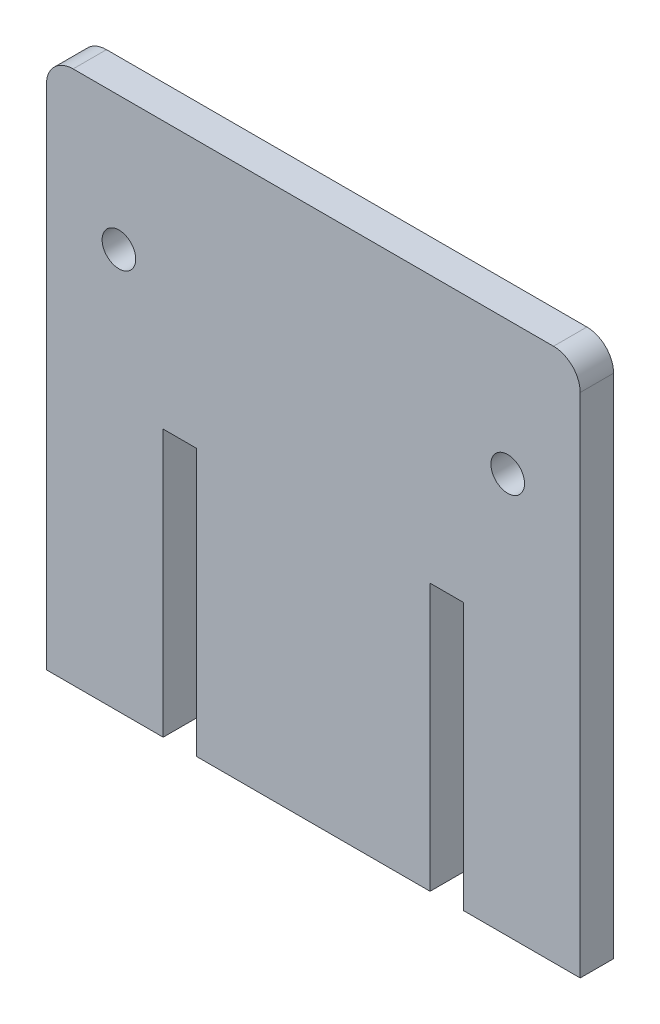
from build123d import *

# Parameters (mm, degrees)
SKETCH1_W           = 50.8
SKETCH1_H           = 50.8
BOSS_EXTRUDE1_DEPTH = 1.5875
SKETCH2_W           = 3.175
SKETCH2_H           = 25.4
CUT_EXTRUDE1_DEPTH  = 37.061067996
FILLET1_R           = 2.54
SKETCH3_R           = 1.6002
CUT_EXTRUDE2_DEPTH  = 37.061067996


with BuildPart() as part:
    # Sketch1 → Boss-Extrude1 (new, symmetric)
    with BuildSketch(Plane.XY):
        Rectangle(SKETCH1_W, SKETCH1_H)
    extrude(amount=BOSS_EXTRUDE1_DEPTH, both=True)

    # Sketch2 → Cut-Extrude1 (cut, through all)
    with BuildSketch(Plane.XY.offset(1.5875)):
        with Locations((-12.7, -12.7)):
            Rectangle(SKETCH2_W, SKETCH2_H)
        with Locations((12.7, -12.7)):
            Rectangle(SKETCH2_W, SKETCH2_H)
    extrude(amount=-CUT_EXTRUDE1_DEPTH, mode=Mode.SUBTRACT)

    # Fillet1
    fillet1_edges = [part.edges().sort_by_distance(p)[0] for p in [
        (-25.4, 25.4, 0),
        (25.4, 25.4, 0),
    ]]
    fillet(fillet1_edges, radius=FILLET1_R)

    # Sketch3 → Cut-Extrude2 (cut, through all)
    with BuildSketch(Plane.XY.offset(1.5875)):
        with Locations((-18.50136, 12.7)):
            Circle(SKETCH3_R)
        with Locations(Location((18.50136, 12.7, 0), (0, 0, 180))):
            Circle(SKETCH3_R)
    extrude(amount=-CUT_EXTRUDE2_DEPTH, mode=Mode.SUBTRACT)


solid = part.part
